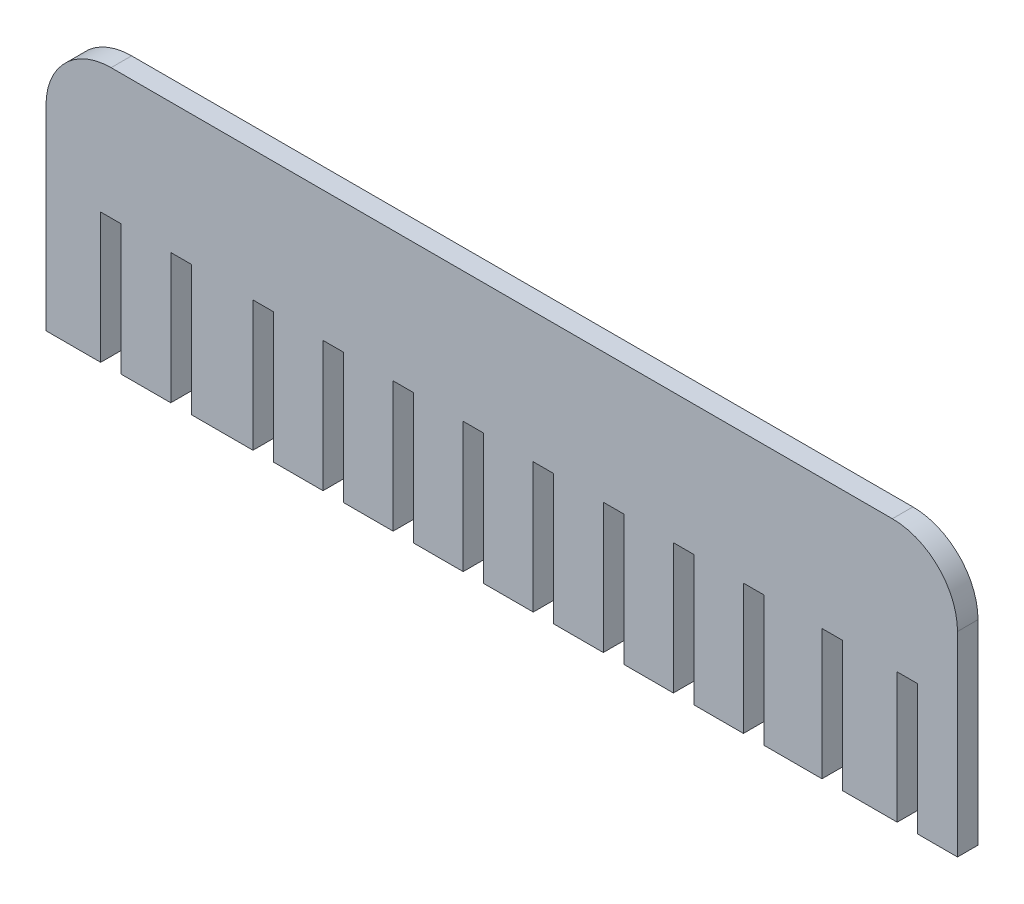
from build123d import *

# Parameters (mm, degrees)
BOSS_EXTRUDE1_DEPTH = 4.000000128
FILLET1_R           = 12.7
FILLET2_R           = 12.7
SKETCH2_W           = 4.000000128
SKETCH2_H           = 25.4
CUT_EXTRUDE3_DEPTH  = 3.048
SKETCH5_W           = 4.000000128
SKETCH5_H           = 25.4
CUT_EXTRUDE4_DEPTH  = 4.000000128
SKETCH6_W           = 177.8
SKETCH6_H           = 127
CUT_EXTRUDE5_DEPTH  = 4.000000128
SKETCH7_W           = 4.000000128
SKETCH7_H           = 25.4
CUT_EXTRUDE6_DEPTH  = 4.000000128
SKETCH8_W           = 4.000000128
SKETCH8_H           = 25.4
CUT_EXTRUDE7_DEPTH  = 4.000000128


with BuildPart() as part:
    # Sketch1 → Boss-Extrude1 (new body)
    with BuildSketch(Plane.XY):
        Polygon((-60.563999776, -88.9), (-49.799999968, -88.9), (-49.799999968, 38.1), (-48.529999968, 38.1), (-48.529999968, 63.5), (-44.52999984, 63.5), (-44.52999984, 38.1), (-34.861999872, 38.1), (-34.861999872, 63.5), (-30.861999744, 63.5), (-30.861999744, 38.1), (-21.193999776, 38.1), (-21.193999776, 63.5), (-17.193999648, 63.5), (-17.193999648, 38.1), (-7.52599968, 38.1), (-7.52599968, 63.5), (-3.525999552, 63.5), (-3.525999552, 38.1), (6.142000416, 38.1), (6.142000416, 63.5), (10.142000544, 63.5), (10.142000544, 38.1), (19.810000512, 38.1), (19.810000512, 63.5), (23.81000064, 63.5), (23.81000064, 38.1), (33.478000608, 38.1), (33.478000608, 63.5), (37.478000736, 63.5), (37.478000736, 38.1), (47.146000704, 38.1), (47.146000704, 63.5), (51.146000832, 63.5), (51.146000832, 38.1), (51.800000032, 38.1), (51.800000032, -88.9), (62.468000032, -88.9), (62.468000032, 38.1), (66.46800016, 38.1), (66.46800016, -88.9), (77.13600016, -88.9), (77.13600016, 38.1), (81.136000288, 38.1), (81.136000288, -88.9), (88.9, -88.9), (88.9, 88.9), (-88.9, 88.9), (-88.9, -88.9), (-78.232, -88.9), (-78.232, 38.1), (-74.231999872, 38.1), (-74.231999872, -88.9), (-64.563999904, -88.9), (-64.563999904, 38.1), (-60.563999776, 38.1), align=None)
    extrude(amount=BOSS_EXTRUDE1_DEPTH)

    # Fillet1
    fillet1_edges = [part.edges().sort_by_distance(p)[0] for p in [
        (88.9, 88.9, 2.000000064),
    ]]
    fillet(fillet1_edges, radius=FILLET1_R)

    # Fillet2
    fillet2_edges = [part.edges().sort_by_distance(p)[0] for p in [
        (-88.9, 88.9, 2.000000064),
    ]]
    fillet(fillet2_edges, radius=FILLET2_R)

    # Sketch2 → Cut-Extrude3 (cut)
    with BuildSketch(Plane.XY.offset(4.000000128)):
        with Locations((79.136000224, 50.8)):
            Rectangle(SKETCH2_W, SKETCH2_H)
        with Locations((64.468000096, 50.8)):
            Rectangle(SKETCH2_W, SKETCH2_H)
    extrude(amount=-CUT_EXTRUDE3_DEPTH, mode=Mode.SUBTRACT)

    # Sketch5 → Cut-Extrude4 (cut)
    with BuildSketch(Plane.XY.offset(4.000000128)):
        with Locations((-76.231999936, 50.8)):
            Rectangle(SKETCH5_W, SKETCH5_H)
        with Locations((-62.56399984, 50.8)):
            Rectangle(SKETCH5_W, SKETCH5_H)
    extrude(amount=-CUT_EXTRUDE4_DEPTH, mode=Mode.SUBTRACT)

    # Sketch6 → Cut-Extrude5 (cut)
    with BuildSketch(Plane.XY.offset(4.000000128)):
        with Locations((0, -25.4)):
            Rectangle(SKETCH6_W, SKETCH6_H)
    extrude(amount=-CUT_EXTRUDE5_DEPTH, mode=Mode.SUBTRACT)

    # Sketch7 → Cut-Extrude6 (cut)
    with BuildSketch(Plane.XY.offset(0.952000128)):
        with Locations((64.468000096, 50.8)):
            Rectangle(SKETCH7_W, SKETCH7_H)
    extrude(amount=-CUT_EXTRUDE6_DEPTH, mode=Mode.SUBTRACT)

    # Sketch8 → Cut-Extrude7 (cut)
    with BuildSketch(Plane.XY.offset(0.952000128)):
        with Locations((79.136000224, 50.8)):
            Rectangle(SKETCH8_W, SKETCH8_H)
    extrude(amount=-CUT_EXTRUDE7_DEPTH, mode=Mode.SUBTRACT)


solid = part.part
